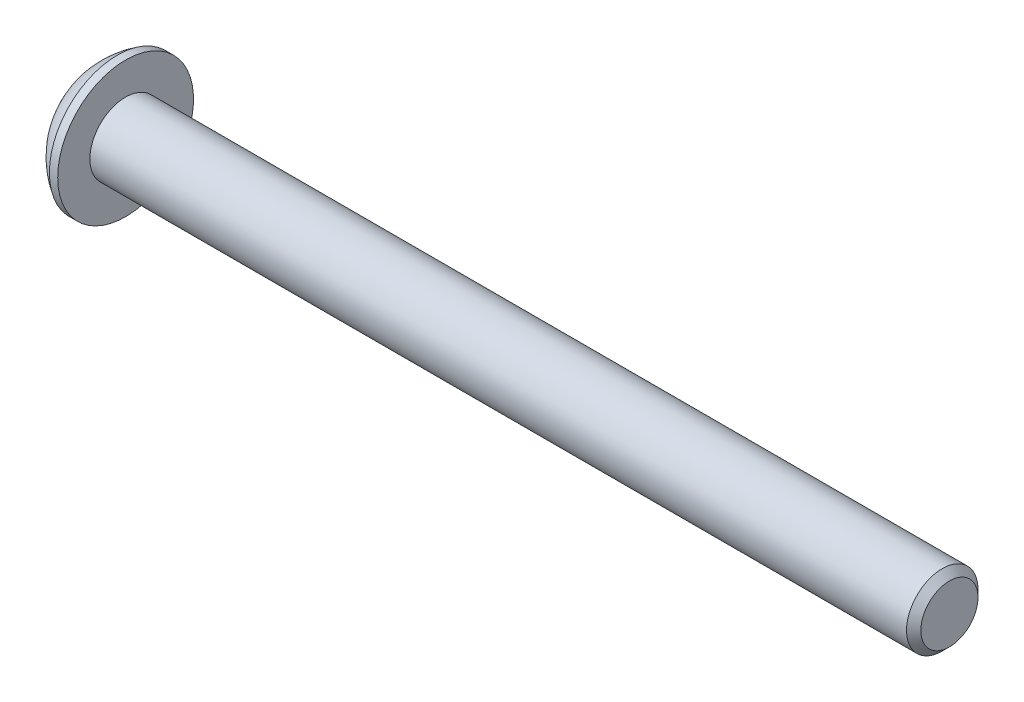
from build123d import *

# Parameters (mm, degrees)
ENL_V_MAT_EXTRU_3_DEPTH = 1


with BuildPart() as part:
    # Esquisse1 → R_volution1 (revolve)
    with BuildSketch(Plane.XY, mode=Mode.PRIVATE) as r_volution1_sk:
        Polygon((58.236786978, 2.85), (58.236786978, 0), (93.166786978, 0), (93.166786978, 1.2), (92.866786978, 1.5), (58.586786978, 1.5), (58.586786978, 2.85), align=None)
        with BuildLine():
            Line((56.936786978, 1.425), (56.936786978, 0))
            Line((56.936786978, 0), (58.236786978, 0))
            Line((58.236786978, 0), (58.236786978, 2.85))
            ThreePointArc((58.236786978, 2.85), (57.482006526, 2.233089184), (56.936786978, 1.425))
        make_face()
    revolve(r_volution1_sk.sketch.rotate(Axis((-65.342662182, 0, 0), (1, 0, 0)), 90), axis=Axis((-65.342662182, 0, 0), (1, 0, 0)))

    # Esquisse2 → Enl_v. mat.-Extru.3 (cut)
    with BuildSketch(Plane.ZY.offset(-56.936786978)):
        Polygon((-1, -0.577350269), (0, -1.154700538), (1, -0.577350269), (1, 0.577350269), (0, 1.154700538), (-1, 0.577350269), align=None)
    extrude(amount=-ENL_V_MAT_EXTRU_3_DEPTH, mode=Mode.SUBTRACT)


solid = part.part
